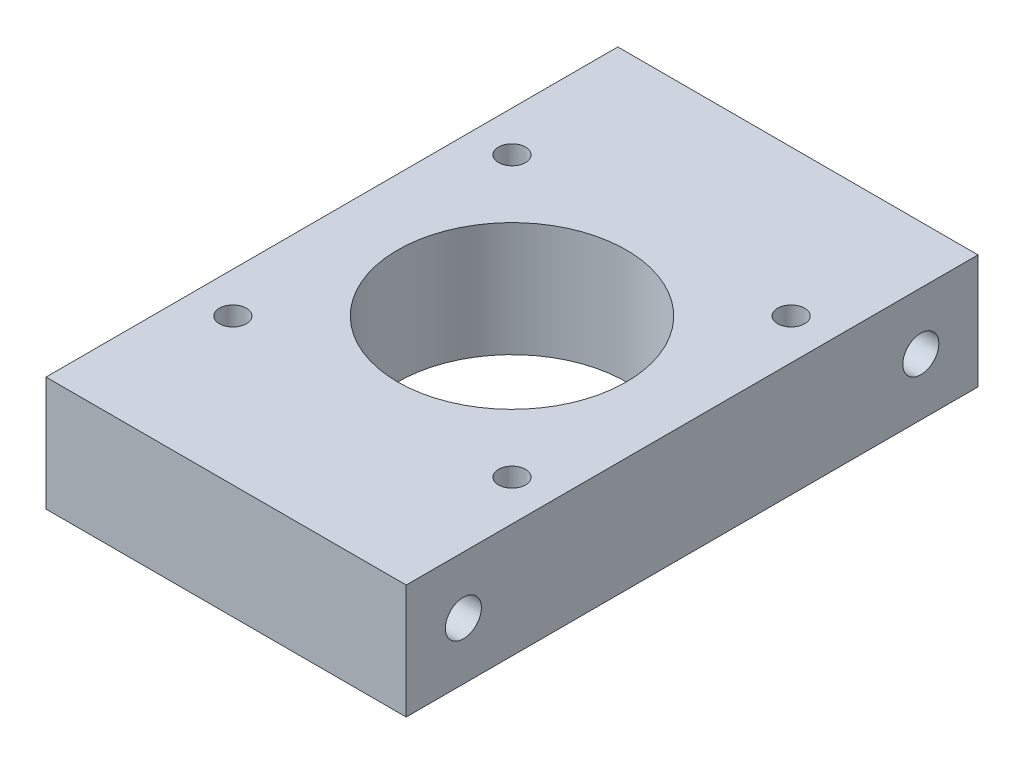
from build123d import *

# Parameters (mm, degrees)
SKETCH1_W           = 40
SKETCH1_H           = 63.5
BOSS_EXTRUDE1_DEPTH = 12.7
SKETCH2_R           = 2
CUT_EXTRUDE1_DEPTH  = 25.4
SKETCH3_R           = 12.7
CUT_EXTRUDE2_DEPTH  = 64.425474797
SKETCH4_R           = 1.5
CUT_EXTRUDE3_DEPTH  = 64.425474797


with BuildPart() as part:
    # Sketch1 → Boss-Extrude1 (new body)
    with BuildSketch(Plane(origin=(0, 0, 0), x_dir=(1, 0, 0), z_dir=(0, 1, 0))):
        with Locations((-22.406536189, -13.672313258)):
            Rectangle(SKETCH1_W, SKETCH1_H)
    extrude(amount=BOSS_EXTRUDE1_DEPTH)

    # Sketch2 → Cut-Extrude1 (cut)
    with BuildSketch(Plane(origin=(-2.406536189, 0, 0), x_dir=(0, 0, -1), z_dir=(1, 0, 0))):
        with Locations((-39.072313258, 6.35)):
            Circle(SKETCH2_R)
        with Locations((11.727686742, 6.35)):
            Circle(SKETCH2_R)
    extrude(amount=-CUT_EXTRUDE1_DEPTH, mode=Mode.SUBTRACT)

    # Sketch3 → Cut-Extrude2 (cut, through all)
    with BuildSketch(Plane(origin=(0, 12.7, 0), x_dir=(1, 0, 0), z_dir=(0, 1, 0))):
        with Locations(Location((-22.406536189, -13.672313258, 0), (0, 0, 270))):
            Circle(SKETCH3_R)
    extrude(amount=-CUT_EXTRUDE2_DEPTH, mode=Mode.SUBTRACT)

    # Sketch4 → Cut-Extrude3 (cut, through all)
    with BuildSketch(Plane(origin=(0, 12.7, 0), x_dir=(1, 0, 0), z_dir=(0, 1, 0))):
        with Locations(Location((-37.906536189, 1.827686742, 0), (0, 0, 270))):
            Circle(SKETCH4_R)
        with Locations(Location((-6.906536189, 1.827686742, 0), (0, 0, 270))):
            Circle(SKETCH4_R)
        with Locations(Location((-6.906536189, -29.172313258, 0), (0, 0, 270))):
            Circle(SKETCH4_R)
        with Locations(Location((-37.906536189, -29.172313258, 0), (0, 0, 270))):
            Circle(SKETCH4_R)
    extrude(amount=-CUT_EXTRUDE3_DEPTH, mode=Mode.SUBTRACT)


solid = part.part
